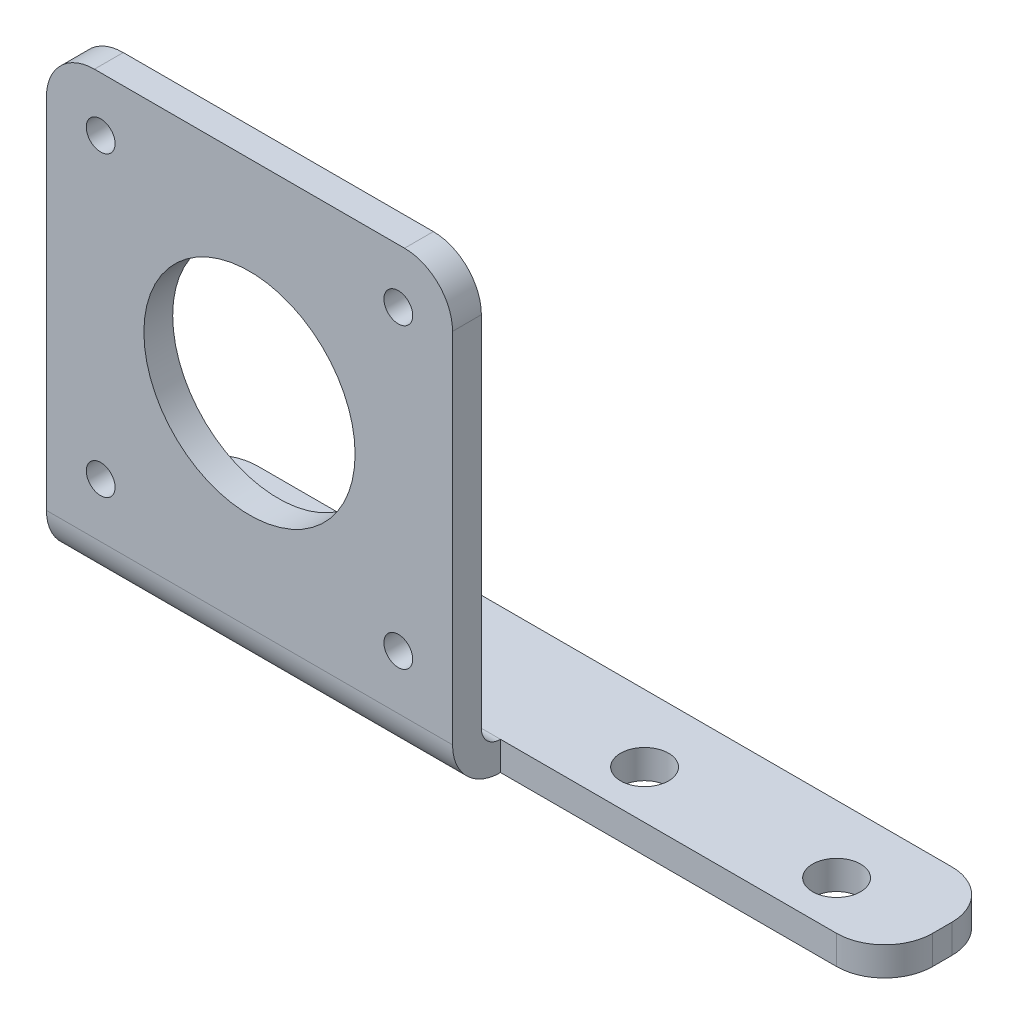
ISO-10303-21;
HEADER;
FILE_DESCRIPTION(('STEP AP214'),'2;1');
FILE_NAME('part.step','',(''),(''),'','','');
FILE_SCHEMA(('AUTOMOTIVE_DESIGN { 1 0 10303 214 1 1 1 1 }'));
ENDSEC;
DATA;
#1=APPLICATION_CONTEXT('core data for automotive mechanical design processes');
#2=APPLICATION_PROTOCOL_DEFINITION('international standard','automotive_design',2000,#1);
#3=PRODUCT_CONTEXT('',#1,'mechanical');
#4=PRODUCT('Part','Part','',(#3));
#5=PRODUCT_RELATED_PRODUCT_CATEGORY('part','',(#4));
#6=PRODUCT_DEFINITION_FORMATION('','',#4);
#7=PRODUCT_DEFINITION_CONTEXT('part definition',#1,'design');
#8=PRODUCT_DEFINITION('design','',#6,#7);
#9=PRODUCT_DEFINITION_SHAPE('','',#8);
#10=(LENGTH_UNIT() NAMED_UNIT(*) SI_UNIT(.MILLI.,.METRE.));
#11=(NAMED_UNIT(*) PLANE_ANGLE_UNIT() SI_UNIT($,.RADIAN.));
#12=(NAMED_UNIT(*) SI_UNIT($,.STERADIAN.) SOLID_ANGLE_UNIT());
#13=UNCERTAINTY_MEASURE_WITH_UNIT(LENGTH_MEASURE(1.E-05),#10,'distance_accuracy_value','');
#14=(GEOMETRIC_REPRESENTATION_CONTEXT(3) GLOBAL_UNCERTAINTY_ASSIGNED_CONTEXT((#13)) GLOBAL_UNIT_ASSIGNED_CONTEXT((#10,
#11,#12)) REPRESENTATION_CONTEXT('',''));
#15=CARTESIAN_POINT('',(0.,0.,0.));
#16=DIRECTION('',(0.,0.,1.));
#17=DIRECTION('',(1.,0.,0.));
#18=AXIS2_PLACEMENT_3D('',#15,#16,#17);
#19=CARTESIAN_POINT('',(60.,-23.15,0.));
#20=DIRECTION('',(0.,-1.,0.));
#21=DIRECTION('',(0.,0.,-1.));
#22=AXIS2_PLACEMENT_3D('',#19,#20,#21);
#23=PLANE('',#22);
#24=CARTESIAN_POINT('',(91.15,-23.15,-7.00000000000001));
#25=DIRECTION('',(0.,1.,0.));
#26=DIRECTION('',(0.,0.,1.));
#27=AXIS2_PLACEMENT_3D('',#24,#25,#26);
#28=CIRCLE('',#27,2.5);
#29=CARTESIAN_POINT('',(91.15,-23.15,-4.50000000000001));
#30=VERTEX_POINT('',#29);
#31=EDGE_CURVE('E216',#30,#30,#28,.F.);
#32=ORIENTED_EDGE('',*,*,#31,.T.);
#33=EDGE_LOOP('',(#32));
#34=FACE_BOUND('',#33,.T.);
#35=CARTESIAN_POINT('',(111.15,-23.15,-7.00000000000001));
#36=DIRECTION('',(0.,1.,0.));
#37=DIRECTION('',(0.,0.,1.));
#38=AXIS2_PLACEMENT_3D('',#35,#36,#37);
#39=CIRCLE('',#38,2.5);
#40=CARTESIAN_POINT('',(111.15,-23.15,-4.50000000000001));
#41=VERTEX_POINT('',#40);
#42=EDGE_CURVE('E213',#41,#41,#39,.F.);
#43=ORIENTED_EDGE('',*,*,#42,.T.);
#44=EDGE_LOOP('',(#43));
#45=FACE_BOUND('',#44,.T.);
#46=CARTESIAN_POINT('',(116.15,-23.15,-9.00000000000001));
#47=DIRECTION('',(0.,1.,0.));
#48=DIRECTION('',(0.,0.,1.));
#49=AXIS2_PLACEMENT_3D('',#46,#47,#48);
#50=CIRCLE('',#49,5.);
#51=CARTESIAN_POINT('',(116.15,-23.15,-14.));
#52=VERTEX_POINT('',#51);
#53=CARTESIAN_POINT('',(121.15,-23.15,-9.00000000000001));
#54=VERTEX_POINT('',#53);
#55=EDGE_CURVE('E220',#52,#54,#50,.F.);
#56=ORIENTED_EDGE('',*,*,#55,.F.);
#57=DIRECTION('',(1.,0.,0.));
#58=VECTOR('',#57,1.);
#59=CARTESIAN_POINT('',(121.15,-23.15,-14.));
#60=LINE('',#59,#58);
#61=CARTESIAN_POINT('',(43.85,-23.15,-14.));
#62=VERTEX_POINT('',#61);
#63=EDGE_CURVE('E119',#62,#52,#60,.T.);
#64=ORIENTED_EDGE('',*,*,#63,.F.);
#65=CARTESIAN_POINT('',(43.85,-23.15,-9.00000000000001));
#66=DIRECTION('',(0.,1.,0.));
#67=DIRECTION('',(0.,0.,1.));
#68=AXIS2_PLACEMENT_3D('',#65,#66,#67);
#69=CIRCLE('',#68,5.);
#70=CARTESIAN_POINT('',(38.85,-23.15,-9.00000000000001));
#71=VERTEX_POINT('',#70);
#72=EDGE_CURVE('E20',#71,#62,#69,.F.);
#73=ORIENTED_EDGE('',*,*,#72,.F.);
#74=DIRECTION('',(0.,0.,1.));
#75=VECTOR('',#74,1.);
#76=CARTESIAN_POINT('',(38.85,-23.15,-14.));
#77=LINE('',#76,#75);
#78=CARTESIAN_POINT('',(38.85,-23.15,-2.));
#79=VERTEX_POINT('',#78);
#80=EDGE_CURVE('E103',#79,#71,#77,.F.);
#81=ORIENTED_EDGE('',*,*,#80,.F.);
#82=DIRECTION('',(1.,0.,0.));
#83=VECTOR('',#82,1.);
#84=CARTESIAN_POINT('',(81.15,-23.15,-2.));
#85=LINE('',#84,#83);
#86=CARTESIAN_POINT('',(81.15,-23.15,-2.));
#87=VERTEX_POINT('',#86);
#88=EDGE_CURVE('E127',#79,#87,#85,.T.);
#89=ORIENTED_EDGE('',*,*,#88,.T.);
#90=DIRECTION('',(1.,0.,0.));
#91=VECTOR('',#90,1.);
#92=CARTESIAN_POINT('',(38.85,-23.15,-2.));
#93=LINE('',#92,#91);
#94=CARTESIAN_POINT('',(116.15,-23.15,-2.));
#95=VERTEX_POINT('',#94);
#96=EDGE_CURVE('E136',#95,#87,#93,.F.);
#97=ORIENTED_EDGE('',*,*,#96,.F.);
#98=CARTESIAN_POINT('',(116.15,-23.15,-7.));
#99=DIRECTION('',(0.,-1.,0.));
#100=DIRECTION('',(0.,0.,-1.));
#101=AXIS2_PLACEMENT_3D('',#98,#99,#100);
#102=CIRCLE('',#101,5.);
#103=CARTESIAN_POINT('',(121.15,-23.15,-7.00000000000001));
#104=VERTEX_POINT('',#103);
#105=EDGE_CURVE('E139',#104,#95,#102,.T.);
#106=ORIENTED_EDGE('',*,*,#105,.F.);
#107=DIRECTION('',(0.,0.,-1.));
#108=VECTOR('',#107,1.);
#109=CARTESIAN_POINT('',(121.15,-23.15,0.));
#110=LINE('',#109,#108);
#111=EDGE_CURVE('E137',#54,#104,#110,.F.);
#112=ORIENTED_EDGE('',*,*,#111,.F.);
#113=EDGE_LOOP('',(#56,#64,#73,#81,#89,#97,#106,#112));
#114=FACE_BOUND('',#113,.T.);
#115=ADVANCED_FACE('F17',(#34,#45,#114),#23,.F.);
#116=CARTESIAN_POINT('',(43.85,-26.15,-9.));
#117=DIRECTION('',(0.,1.,0.));
#118=DIRECTION('',(0.,0.,1.));
#119=AXIS2_PLACEMENT_3D('',#116,#117,#118);
#120=CYLINDRICAL_SURFACE('',#119,5.);
#121=ORIENTED_EDGE('',*,*,#72,.T.);
#122=DIRECTION('',(0.,1.,0.));
#123=VECTOR('',#122,1.);
#124=CARTESIAN_POINT('',(43.85,-26.15,-14.));
#125=LINE('',#124,#123);
#126=CARTESIAN_POINT('',(43.85,-26.15,-14.));
#127=VERTEX_POINT('',#126);
#128=EDGE_CURVE('E123',#127,#62,#125,.T.);
#129=ORIENTED_EDGE('',*,*,#128,.F.);
#130=CARTESIAN_POINT('',(43.85,-26.15,-9.));
#131=DIRECTION('',(0.,1.,0.));
#132=DIRECTION('',(0.,0.,1.));
#133=AXIS2_PLACEMENT_3D('',#130,#131,#132);
#134=CIRCLE('',#133,5.);
#135=CARTESIAN_POINT('',(38.85,-26.15,-9.));
#136=VERTEX_POINT('',#135);
#137=EDGE_CURVE('E126',#136,#127,#134,.F.);
#138=ORIENTED_EDGE('',*,*,#137,.F.);
#139=DIRECTION('',(0.,1.,0.));
#140=VECTOR('',#139,1.);
#141=CARTESIAN_POINT('',(38.85,-26.15,-9.));
#142=LINE('',#141,#140);
#143=EDGE_CURVE('E108',#71,#136,#142,.F.);
#144=ORIENTED_EDGE('',*,*,#143,.F.);
#145=EDGE_LOOP('',(#121,#129,#138,#144));
#146=FACE_BOUND('',#145,.T.);
#147=ADVANCED_FACE('F125',(#146),#120,.T.);
#148=CARTESIAN_POINT('',(121.15,-26.15,-14.));
#149=DIRECTION('',(0.,0.,-1.));
#150=DIRECTION('',(0.,1.,0.));
#151=AXIS2_PLACEMENT_3D('',#148,#149,#150);
#152=PLANE('',#151);
#153=ORIENTED_EDGE('',*,*,#63,.T.);
#154=DIRECTION('',(0.,1.,0.));
#155=VECTOR('',#154,1.);
#156=CARTESIAN_POINT('',(116.15,-26.15,-14.));
#157=LINE('',#156,#155);
#158=CARTESIAN_POINT('',(116.15,-26.15,-14.));
#159=VERTEX_POINT('',#158);
#160=EDGE_CURVE('E141',#159,#52,#157,.T.);
#161=ORIENTED_EDGE('',*,*,#160,.F.);
#162=DIRECTION('',(1.,0.,0.));
#163=VECTOR('',#162,1.);
#164=CARTESIAN_POINT('',(60.,-26.15,-14.));
#165=LINE('',#164,#163);
#166=EDGE_CURVE('E210',#127,#159,#165,.T.);
#167=ORIENTED_EDGE('',*,*,#166,.F.);
#168=ORIENTED_EDGE('',*,*,#128,.T.);
#169=EDGE_LOOP('',(#153,#161,#167,#168));
#170=FACE_BOUND('',#169,.T.);
#171=ADVANCED_FACE('F318',(#170),#152,.T.);
#172=CARTESIAN_POINT('',(116.15,-26.15,-9.));
#173=DIRECTION('',(0.,1.,0.));
#174=DIRECTION('',(0.,0.,1.));
#175=AXIS2_PLACEMENT_3D('',#172,#173,#174);
#176=CYLINDRICAL_SURFACE('',#175,5.);
#177=ORIENTED_EDGE('',*,*,#55,.T.);
#178=DIRECTION('',(0.,1.,0.));
#179=VECTOR('',#178,1.);
#180=CARTESIAN_POINT('',(121.15,-26.15,-9.));
#181=LINE('',#180,#179);
#182=CARTESIAN_POINT('',(121.15,-26.15,-9.));
#183=VERTEX_POINT('',#182);
#184=EDGE_CURVE('E140',#183,#54,#181,.T.);
#185=ORIENTED_EDGE('',*,*,#184,.F.);
#186=CARTESIAN_POINT('',(116.15,-26.15,-9.));
#187=DIRECTION('',(0.,1.,0.));
#188=DIRECTION('',(0.,0.,1.));
#189=AXIS2_PLACEMENT_3D('',#186,#187,#188);
#190=CIRCLE('',#189,5.);
#191=EDGE_CURVE('E208',#159,#183,#190,.F.);
#192=ORIENTED_EDGE('',*,*,#191,.F.);
#193=ORIENTED_EDGE('',*,*,#160,.T.);
#194=EDGE_LOOP('',(#177,#185,#192,#193));
#195=FACE_BOUND('',#194,.T.);
#196=ADVANCED_FACE('F316',(#195),#176,.T.);
#197=CARTESIAN_POINT('',(121.15,-26.15,0.));
#198=DIRECTION('',(1.,0.,0.));
#199=DIRECTION('',(0.,0.,-1.));
#200=AXIS2_PLACEMENT_3D('',#197,#198,#199);
#201=PLANE('',#200);
#202=ORIENTED_EDGE('',*,*,#111,.T.);
#203=DIRECTION('',(0.,-1.,0.));
#204=VECTOR('',#203,1.);
#205=CARTESIAN_POINT('',(121.15,-23.15,-7.00000000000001));
#206=LINE('',#205,#204);
#207=CARTESIAN_POINT('',(121.15,-26.15,-6.99999999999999));
#208=VERTEX_POINT('',#207);
#209=EDGE_CURVE('E219',#208,#104,#206,.F.);
#210=ORIENTED_EDGE('',*,*,#209,.F.);
#211=DIRECTION('',(0.,0.,-1.));
#212=VECTOR('',#211,1.);
#213=CARTESIAN_POINT('',(121.15,-26.15,0.));
#214=LINE('',#213,#212);
#215=EDGE_CURVE('E207',#183,#208,#214,.F.);
#216=ORIENTED_EDGE('',*,*,#215,.F.);
#217=ORIENTED_EDGE('',*,*,#184,.T.);
#218=EDGE_LOOP('',(#202,#210,#216,#217));
#219=FACE_BOUND('',#218,.T.);
#220=ADVANCED_FACE('F315',(#219),#201,.T.);
#221=CARTESIAN_POINT('',(116.15,-23.15,-7.));
#222=DIRECTION('',(0.,-1.,0.));
#223=DIRECTION('',(0.,0.,-1.));
#224=AXIS2_PLACEMENT_3D('',#221,#222,#223);
#225=CYLINDRICAL_SURFACE('',#224,5.);
#226=CARTESIAN_POINT('',(116.15,-26.15,-6.99999999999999));
#227=DIRECTION('',(0.,-1.,0.));
#228=DIRECTION('',(0.,0.,-1.));
#229=AXIS2_PLACEMENT_3D('',#226,#227,#228);
#230=CIRCLE('',#229,5.);
#231=CARTESIAN_POINT('',(116.15,-26.15,-1.99999999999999));
#232=VERTEX_POINT('',#231);
#233=EDGE_CURVE('E204',#208,#232,#230,.T.);
#234=ORIENTED_EDGE('',*,*,#233,.F.);
#235=ORIENTED_EDGE('',*,*,#209,.T.);
#236=ORIENTED_EDGE('',*,*,#105,.T.);
#237=DIRECTION('',(0.,-1.,0.));
#238=VECTOR('',#237,1.);
#239=CARTESIAN_POINT('',(116.15,-23.15,-2.));
#240=LINE('',#239,#238);
#241=EDGE_CURVE('E114',#232,#95,#240,.F.);
#242=ORIENTED_EDGE('',*,*,#241,.F.);
#243=EDGE_LOOP('',(#234,#235,#236,#242));
#244=FACE_BOUND('',#243,.T.);
#245=ADVANCED_FACE('F310',(#244),#225,.T.);
#246=CARTESIAN_POINT('',(91.15,-26.15,-7.));
#247=DIRECTION('',(0.,1.,0.));
#248=DIRECTION('',(0.,0.,1.));
#249=AXIS2_PLACEMENT_3D('',#246,#247,#248);
#250=CYLINDRICAL_SURFACE('',#249,2.5);
#251=CARTESIAN_POINT('',(91.15,-26.15,-7.));
#252=DIRECTION('',(0.,1.,0.));
#253=DIRECTION('',(0.,0.,1.));
#254=AXIS2_PLACEMENT_3D('',#251,#252,#253);
#255=CIRCLE('',#254,2.5);
#256=CARTESIAN_POINT('',(91.15,-26.15,-4.5));
#257=VERTEX_POINT('',#256);
#258=EDGE_CURVE('E201',#257,#257,#255,.T.);
#259=ORIENTED_EDGE('',*,*,#258,.F.);
#260=EDGE_LOOP('',(#259));
#261=FACE_BOUND('',#260,.T.);
#262=ORIENTED_EDGE('',*,*,#31,.F.);
#263=EDGE_LOOP('',(#262));
#264=FACE_BOUND('',#263,.T.);
#265=ADVANCED_FACE('F381',(#261,#264),#250,.F.);
#266=CARTESIAN_POINT('',(111.15,-26.15,-7.));
#267=DIRECTION('',(0.,1.,0.));
#268=DIRECTION('',(0.,0.,1.));
#269=AXIS2_PLACEMENT_3D('',#266,#267,#268);
#270=CYLINDRICAL_SURFACE('',#269,2.5);
#271=CARTESIAN_POINT('',(111.15,-26.15,-7.));
#272=DIRECTION('',(0.,1.,0.));
#273=DIRECTION('',(0.,0.,1.));
#274=AXIS2_PLACEMENT_3D('',#271,#272,#273);
#275=CIRCLE('',#274,2.5);
#276=CARTESIAN_POINT('',(111.15,-26.15,-4.5));
#277=VERTEX_POINT('',#276);
#278=EDGE_CURVE('E198',#277,#277,#275,.T.);
#279=ORIENTED_EDGE('',*,*,#278,.F.);
#280=EDGE_LOOP('',(#279));
#281=FACE_BOUND('',#280,.T.);
#282=ORIENTED_EDGE('',*,*,#42,.F.);
#283=EDGE_LOOP('',(#282));
#284=FACE_BOUND('',#283,.T.);
#285=ADVANCED_FACE('F378',(#281,#284),#270,.F.);
#286=CARTESIAN_POINT('',(38.85,-23.15,-2.));
#287=DIRECTION('',(0.,0.,1.));
#288=DIRECTION('',(0.,-1.,0.));
#289=AXIS2_PLACEMENT_3D('',#286,#287,#288);
#290=PLANE('',#289);
#291=DIRECTION('',(1.,0.,0.));
#292=VECTOR('',#291,1.);
#293=CARTESIAN_POINT('',(60.,-26.15,-2.));
#294=LINE('',#293,#292);
#295=CARTESIAN_POINT('',(81.15,-26.15,-2.));
#296=VERTEX_POINT('',#295);
#297=EDGE_CURVE('E129',#232,#296,#294,.F.);
#298=ORIENTED_EDGE('',*,*,#297,.F.);
#299=ORIENTED_EDGE('',*,*,#241,.T.);
#300=ORIENTED_EDGE('',*,*,#96,.T.);
#301=DIRECTION('',(0.,1.,0.));
#302=VECTOR('',#301,1.);
#303=CARTESIAN_POINT('',(81.15,-21.15,-2.));
#304=LINE('',#303,#302);
#305=EDGE_CURVE('E197',#87,#296,#304,.F.);
#306=ORIENTED_EDGE('',*,*,#305,.T.);
#307=EDGE_LOOP('',(#298,#299,#300,#306));
#308=FACE_BOUND('',#307,.T.);
#309=ADVANCED_FACE('F307',(#308),#290,.T.);
#310=CARTESIAN_POINT('',(81.15,-21.15,-2.));
#311=DIRECTION('',(1.,0.,0.));
#312=DIRECTION('',(0.,0.,-1.));
#313=AXIS2_PLACEMENT_3D('',#310,#311,#312);
#314=CYLINDRICAL_SURFACE('',#313,2.);
#315=CARTESIAN_POINT('',(81.15,-21.15,-2.));
#316=DIRECTION('',(1.,0.,0.));
#317=DIRECTION('',(0.,0.,-1.));
#318=AXIS2_PLACEMENT_3D('',#315,#316,#317);
#319=CIRCLE('',#318,2.);
#320=CARTESIAN_POINT('',(81.15,-21.15,0.));
#321=VERTEX_POINT('',#320);
#322=EDGE_CURVE('E194',#321,#87,#319,.T.);
#323=ORIENTED_EDGE('',*,*,#322,.T.);
#324=ORIENTED_EDGE('',*,*,#88,.F.);
#325=CARTESIAN_POINT('',(38.85,-21.15,-2.));
#326=DIRECTION('',(1.,0.,0.));
#327=DIRECTION('',(0.,0.,-1.));
#328=AXIS2_PLACEMENT_3D('',#325,#326,#327);
#329=CIRCLE('',#328,2.);
#330=CARTESIAN_POINT('',(38.85,-21.15,0.));
#331=VERTEX_POINT('',#330);
#332=EDGE_CURVE('E111',#331,#79,#329,.T.);
#333=ORIENTED_EDGE('',*,*,#332,.F.);
#334=DIRECTION('',(-1.,0.,0.));
#335=VECTOR('',#334,1.);
#336=CARTESIAN_POINT('',(60.,-21.15,0.));
#337=LINE('',#336,#335);
#338=EDGE_CURVE('E192',#321,#331,#337,.T.);
#339=ORIENTED_EDGE('',*,*,#338,.F.);
#340=EDGE_LOOP('',(#323,#324,#333,#339));
#341=FACE_BOUND('',#340,.T.);
#342=ADVANCED_FACE('F302',(#341),#314,.F.);
#343=CARTESIAN_POINT('',(60.,-26.15,0.));
#344=DIRECTION('',(0.,-1.,0.));
#345=DIRECTION('',(0.,0.,-1.));
#346=AXIS2_PLACEMENT_3D('',#343,#344,#345);
#347=PLANE('',#346);
#348=ORIENTED_EDGE('',*,*,#278,.T.);
#349=EDGE_LOOP('',(#348));
#350=FACE_BOUND('',#349,.T.);
#351=ORIENTED_EDGE('',*,*,#258,.T.);
#352=EDGE_LOOP('',(#351));
#353=FACE_BOUND('',#352,.T.);
#354=ORIENTED_EDGE('',*,*,#215,.T.);
#355=ORIENTED_EDGE('',*,*,#233,.T.);
#356=ORIENTED_EDGE('',*,*,#297,.T.);
#357=DIRECTION('',(1.,0.,0.));
#358=VECTOR('',#357,1.);
#359=CARTESIAN_POINT('',(81.15,-26.15,-2.));
#360=LINE('',#359,#358);
#361=CARTESIAN_POINT('',(38.85,-26.15,-1.99999999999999));
#362=VERTEX_POINT('',#361);
#363=EDGE_CURVE('E182',#362,#296,#360,.T.);
#364=ORIENTED_EDGE('',*,*,#363,.F.);
#365=DIRECTION('',(0.,0.,-1.));
#366=VECTOR('',#365,1.);
#367=CARTESIAN_POINT('',(38.85,-26.15,0.));
#368=LINE('',#367,#366);
#369=EDGE_CURVE('E212',#362,#136,#368,.T.);
#370=ORIENTED_EDGE('',*,*,#369,.T.);
#371=ORIENTED_EDGE('',*,*,#137,.T.);
#372=ORIENTED_EDGE('',*,*,#166,.T.);
#373=ORIENTED_EDGE('',*,*,#191,.T.);
#374=EDGE_LOOP('',(#354,#355,#356,#364,#370,#371,#372,#373));
#375=FACE_BOUND('',#374,.T.);
#376=ADVANCED_FACE('F311',(#350,#353,#375),#347,.T.);
#377=CARTESIAN_POINT('',(60.,0.,0.));
#378=DIRECTION('',(0.,0.,-1.));
#379=DIRECTION('',(-1.,0.,0.));
#380=AXIS2_PLACEMENT_3D('',#377,#378,#379);
#381=PLANE('',#380);
#382=CARTESIAN_POINT('',(44.5,-15.5,0.));
#383=DIRECTION('',(0.,0.,-1.));
#384=DIRECTION('',(-1.,0.,0.));
#385=AXIS2_PLACEMENT_3D('',#382,#383,#384);
#386=CIRCLE('',#385,1.5);
#387=CARTESIAN_POINT('',(43.,-15.5,0.));
#388=VERTEX_POINT('',#387);
#389=EDGE_CURVE('E163',#388,#388,#386,.F.);
#390=ORIENTED_EDGE('',*,*,#389,.T.);
#391=EDGE_LOOP('',(#390));
#392=FACE_BOUND('',#391,.T.);
#393=CARTESIAN_POINT('',(75.5,15.5,0.));
#394=DIRECTION('',(0.,0.,-1.));
#395=DIRECTION('',(-1.,0.,0.));
#396=AXIS2_PLACEMENT_3D('',#393,#394,#395);
#397=CIRCLE('',#396,1.5);
#398=CARTESIAN_POINT('',(74.,15.5,0.));
#399=VERTEX_POINT('',#398);
#400=EDGE_CURVE('E169',#399,#399,#397,.F.);
#401=ORIENTED_EDGE('',*,*,#400,.T.);
#402=EDGE_LOOP('',(#401));
#403=FACE_BOUND('',#402,.T.);
#404=CARTESIAN_POINT('',(60.,0.,0.));
#405=DIRECTION('',(0.,0.,-1.));
#406=DIRECTION('',(-1.,0.,0.));
#407=AXIS2_PLACEMENT_3D('',#404,#405,#406);
#408=CIRCLE('',#407,11.);
#409=CARTESIAN_POINT('',(49.,0.,0.));
#410=VERTEX_POINT('',#409);
#411=EDGE_CURVE('E175',#410,#410,#408,.F.);
#412=ORIENTED_EDGE('',*,*,#411,.T.);
#413=EDGE_LOOP('',(#412));
#414=FACE_BOUND('',#413,.T.);
#415=CARTESIAN_POINT('',(44.5,15.5,0.));
#416=DIRECTION('',(0.,0.,-1.));
#417=DIRECTION('',(-1.,0.,0.));
#418=AXIS2_PLACEMENT_3D('',#415,#416,#417);
#419=CIRCLE('',#418,1.5);
#420=CARTESIAN_POINT('',(43.,15.5,0.));
#421=VERTEX_POINT('',#420);
#422=EDGE_CURVE('E172',#421,#421,#419,.F.);
#423=ORIENTED_EDGE('',*,*,#422,.T.);
#424=EDGE_LOOP('',(#423));
#425=FACE_BOUND('',#424,.T.);
#426=CARTESIAN_POINT('',(75.5,-15.5,0.));
#427=DIRECTION('',(0.,0.,-1.));
#428=DIRECTION('',(-1.,0.,0.));
#429=AXIS2_PLACEMENT_3D('',#426,#427,#428);
#430=CIRCLE('',#429,1.5);
#431=CARTESIAN_POINT('',(74.,-15.5,0.));
#432=VERTEX_POINT('',#431);
#433=EDGE_CURVE('E166',#432,#432,#430,.F.);
#434=ORIENTED_EDGE('',*,*,#433,.T.);
#435=EDGE_LOOP('',(#434));
#436=FACE_BOUND('',#435,.T.);
#437=DIRECTION('',(0.,1.,0.));
#438=VECTOR('',#437,1.);
#439=CARTESIAN_POINT('',(38.85,21.15,0.));
#440=LINE('',#439,#438);
#441=CARTESIAN_POINT('',(38.85,16.15,0.));
#442=VERTEX_POINT('',#441);
#443=EDGE_CURVE('E178',#331,#442,#440,.T.);
#444=ORIENTED_EDGE('',*,*,#443,.T.);
#445=CARTESIAN_POINT('',(43.85,16.15,0.));
#446=DIRECTION('',(0.,0.,-1.));
#447=DIRECTION('',(-1.,0.,0.));
#448=AXIS2_PLACEMENT_3D('',#445,#446,#447);
#449=CIRCLE('',#448,5.);
#450=CARTESIAN_POINT('',(43.85,21.15,0.));
#451=VERTEX_POINT('',#450);
#452=EDGE_CURVE('E189',#451,#442,#449,.F.);
#453=ORIENTED_EDGE('',*,*,#452,.F.);
#454=DIRECTION('',(1.,0.,0.));
#455=VECTOR('',#454,1.);
#456=CARTESIAN_POINT('',(38.85,21.15,0.));
#457=LINE('',#456,#455);
#458=CARTESIAN_POINT('',(76.15,21.15,0.));
#459=VERTEX_POINT('',#458);
#460=EDGE_CURVE('E188',#451,#459,#457,.T.);
#461=ORIENTED_EDGE('',*,*,#460,.T.);
#462=CARTESIAN_POINT('',(76.15,16.15,0.));
#463=DIRECTION('',(0.,0.,-1.));
#464=DIRECTION('',(-1.,0.,0.));
#465=AXIS2_PLACEMENT_3D('',#462,#463,#464);
#466=CIRCLE('',#465,5.);
#467=CARTESIAN_POINT('',(81.15,16.15,0.));
#468=VERTEX_POINT('',#467);
#469=EDGE_CURVE('E185',#468,#459,#466,.F.);
#470=ORIENTED_EDGE('',*,*,#469,.F.);
#471=DIRECTION('',(0.,1.,0.));
#472=VECTOR('',#471,1.);
#473=CARTESIAN_POINT('',(81.15,21.15,0.));
#474=LINE('',#473,#472);
#475=EDGE_CURVE('E184',#468,#321,#474,.F.);
#476=ORIENTED_EDGE('',*,*,#475,.T.);
#477=ORIENTED_EDGE('',*,*,#338,.T.);
#478=EDGE_LOOP('',(#444,#453,#461,#470,#476,#477));
#479=FACE_BOUND('',#478,.T.);
#480=ADVANCED_FACE('F298',(#392,#403,#414,#425,#436,#479),#381,.T.);
#481=CARTESIAN_POINT('',(43.85,16.15,3.));
#482=DIRECTION('',(0.,0.,-1.));
#483=DIRECTION('',(-1.,0.,0.));
#484=AXIS2_PLACEMENT_3D('',#481,#482,#483);
#485=CYLINDRICAL_SURFACE('',#484,5.);
#486=ORIENTED_EDGE('',*,*,#452,.T.);
#487=DIRECTION('',(0.,0.,-1.));
#488=VECTOR('',#487,1.);
#489=CARTESIAN_POINT('',(38.85,16.15,3.));
#490=LINE('',#489,#488);
#491=CARTESIAN_POINT('',(38.85,16.15,3.));
#492=VERTEX_POINT('',#491);
#493=EDGE_CURVE('E181',#442,#492,#490,.F.);
#494=ORIENTED_EDGE('',*,*,#493,.T.);
#495=CARTESIAN_POINT('',(43.85,16.15,3.));
#496=DIRECTION('',(0.,0.,-1.));
#497=DIRECTION('',(-1.,0.,0.));
#498=AXIS2_PLACEMENT_3D('',#495,#496,#497);
#499=CIRCLE('',#498,5.);
#500=CARTESIAN_POINT('',(43.85,21.15,3.));
#501=VERTEX_POINT('',#500);
#502=EDGE_CURVE('E160',#492,#501,#499,.T.);
#503=ORIENTED_EDGE('',*,*,#502,.T.);
#504=DIRECTION('',(0.,0.,-1.));
#505=VECTOR('',#504,1.);
#506=CARTESIAN_POINT('',(43.85,21.15,3.));
#507=LINE('',#506,#505);
#508=EDGE_CURVE('E191',#501,#451,#507,.T.);
#509=ORIENTED_EDGE('',*,*,#508,.T.);
#510=EDGE_LOOP('',(#486,#494,#503,#509));
#511=FACE_BOUND('',#510,.T.);
#512=ADVANCED_FACE('F296',(#511),#485,.T.);
#513=CARTESIAN_POINT('',(38.85,21.15,3.));
#514=DIRECTION('',(0.,-1.,0.));
#515=DIRECTION('',(0.,0.,-1.));
#516=AXIS2_PLACEMENT_3D('',#513,#514,#515);
#517=PLANE('',#516);
#518=DIRECTION('',(0.,0.,-1.));
#519=VECTOR('',#518,1.);
#520=CARTESIAN_POINT('',(76.15,21.15,3.));
#521=LINE('',#520,#519);
#522=CARTESIAN_POINT('',(76.15,21.15,3.));
#523=VERTEX_POINT('',#522);
#524=EDGE_CURVE('E187',#459,#523,#521,.F.);
#525=ORIENTED_EDGE('',*,*,#524,.F.);
#526=ORIENTED_EDGE('',*,*,#460,.F.);
#527=ORIENTED_EDGE('',*,*,#508,.F.);
#528=DIRECTION('',(-1.,0.,0.));
#529=VECTOR('',#528,1.);
#530=CARTESIAN_POINT('',(60.,21.15,3.));
#531=LINE('',#530,#529);
#532=EDGE_CURVE('E159',#501,#523,#531,.F.);
#533=ORIENTED_EDGE('',*,*,#532,.T.);
#534=EDGE_LOOP('',(#525,#526,#527,#533));
#535=FACE_BOUND('',#534,.T.);
#536=ADVANCED_FACE('F294',(#535),#517,.F.);
#537=CARTESIAN_POINT('',(76.15,16.15,3.));
#538=DIRECTION('',(0.,0.,-1.));
#539=DIRECTION('',(-1.,0.,0.));
#540=AXIS2_PLACEMENT_3D('',#537,#538,#539);
#541=CYLINDRICAL_SURFACE('',#540,5.);
#542=ORIENTED_EDGE('',*,*,#469,.T.);
#543=ORIENTED_EDGE('',*,*,#524,.T.);
#544=CARTESIAN_POINT('',(76.15,16.15,3.));
#545=DIRECTION('',(0.,0.,-1.));
#546=DIRECTION('',(-1.,0.,0.));
#547=AXIS2_PLACEMENT_3D('',#544,#545,#546);
#548=CIRCLE('',#547,5.);
#549=CARTESIAN_POINT('',(81.15,16.15,3.));
#550=VERTEX_POINT('',#549);
#551=EDGE_CURVE('E155',#523,#550,#548,.T.);
#552=ORIENTED_EDGE('',*,*,#551,.T.);
#553=DIRECTION('',(0.,0.,1.));
#554=VECTOR('',#553,1.);
#555=CARTESIAN_POINT('',(81.15,16.15,3.));
#556=LINE('',#555,#554);
#557=EDGE_CURVE('E236',#550,#468,#556,.F.);
#558=ORIENTED_EDGE('',*,*,#557,.T.);
#559=EDGE_LOOP('',(#542,#543,#552,#558));
#560=FACE_BOUND('',#559,.T.);
#561=ADVANCED_FACE('F291',(#560),#541,.T.);
#562=CARTESIAN_POINT('',(81.15,21.15,3.));
#563=DIRECTION('',(-1.,0.,0.));
#564=DIRECTION('',(0.,0.,1.));
#565=AXIS2_PLACEMENT_3D('',#562,#563,#564);
#566=PLANE('',#565);
#567=DIRECTION('',(0.,1.,0.));
#568=VECTOR('',#567,1.);
#569=CARTESIAN_POINT('',(81.15,0.,3.));
#570=LINE('',#569,#568);
#571=CARTESIAN_POINT('',(81.15,-21.15,3.));
#572=VERTEX_POINT('',#571);
#573=EDGE_CURVE('E158',#550,#572,#570,.F.);
#574=ORIENTED_EDGE('',*,*,#573,.T.);
#575=CARTESIAN_POINT('',(81.15,-21.15,-2.));
#576=DIRECTION('',(1.,0.,0.));
#577=DIRECTION('',(0.,0.,-1.));
#578=AXIS2_PLACEMENT_3D('',#575,#576,#577);
#579=CIRCLE('',#578,5.);
#580=EDGE_CURVE('E179',#296,#572,#579,.F.);
#581=ORIENTED_EDGE('',*,*,#580,.F.);
#582=ORIENTED_EDGE('',*,*,#305,.F.);
#583=ORIENTED_EDGE('',*,*,#322,.F.);
#584=ORIENTED_EDGE('',*,*,#475,.F.);
#585=ORIENTED_EDGE('',*,*,#557,.F.);
#586=EDGE_LOOP('',(#574,#581,#582,#583,#584,#585));
#587=FACE_BOUND('',#586,.T.);
#588=ADVANCED_FACE('F279',(#587),#566,.F.);
#589=CARTESIAN_POINT('',(81.15,-21.15,-2.));
#590=DIRECTION('',(1.,0.,0.));
#591=DIRECTION('',(0.,0.,-1.));
#592=AXIS2_PLACEMENT_3D('',#589,#590,#591);
#593=CYLINDRICAL_SURFACE('',#592,5.);
#594=ORIENTED_EDGE('',*,*,#363,.T.);
#595=ORIENTED_EDGE('',*,*,#580,.T.);
#596=DIRECTION('',(-1.,0.,0.));
#597=VECTOR('',#596,1.);
#598=CARTESIAN_POINT('',(60.,-21.15,3.));
#599=LINE('',#598,#597);
#600=CARTESIAN_POINT('',(38.85,-21.15,3.));
#601=VERTEX_POINT('',#600);
#602=EDGE_CURVE('E255',#572,#601,#599,.T.);
#603=ORIENTED_EDGE('',*,*,#602,.T.);
#604=CARTESIAN_POINT('',(38.85,-21.15,-2.));
#605=DIRECTION('',(1.,0.,0.));
#606=DIRECTION('',(0.,0.,-1.));
#607=AXIS2_PLACEMENT_3D('',#604,#605,#606);
#608=CIRCLE('',#607,5.);
#609=EDGE_CURVE('E35',#601,#362,#608,.T.);
#610=ORIENTED_EDGE('',*,*,#609,.T.);
#611=EDGE_LOOP('',(#594,#595,#603,#610));
#612=FACE_BOUND('',#611,.T.);
#613=ADVANCED_FACE('F274',(#612),#593,.T.);
#614=CARTESIAN_POINT('',(38.85,21.15,3.));
#615=DIRECTION('',(1.,0.,0.));
#616=DIRECTION('',(0.,0.,-1.));
#617=AXIS2_PLACEMENT_3D('',#614,#615,#616);
#618=PLANE('',#617);
#619=ORIENTED_EDGE('',*,*,#443,.F.);
#620=ORIENTED_EDGE('',*,*,#332,.T.);
#621=ORIENTED_EDGE('',*,*,#80,.T.);
#622=ORIENTED_EDGE('',*,*,#143,.T.);
#623=ORIENTED_EDGE('',*,*,#369,.F.);
#624=ORIENTED_EDGE('',*,*,#609,.F.);
#625=DIRECTION('',(0.,1.,0.));
#626=VECTOR('',#625,1.);
#627=CARTESIAN_POINT('',(38.85,0.,3.));
#628=LINE('',#627,#626);
#629=EDGE_CURVE('E154',#601,#492,#628,.T.);
#630=ORIENTED_EDGE('',*,*,#629,.T.);
#631=ORIENTED_EDGE('',*,*,#493,.F.);
#632=EDGE_LOOP('',(#619,#620,#621,#622,#623,#624,#630,#631));
#633=FACE_BOUND('',#632,.T.);
#634=ADVANCED_FACE('F106',(#633),#618,.F.);
#635=CARTESIAN_POINT('',(60.,0.,3.));
#636=DIRECTION('',(0.,0.,-1.));
#637=DIRECTION('',(-1.,0.,0.));
#638=AXIS2_PLACEMENT_3D('',#635,#636,#637);
#639=CYLINDRICAL_SURFACE('',#638,11.);
#640=CARTESIAN_POINT('',(60.,0.,3.));
#641=DIRECTION('',(0.,0.,-1.));
#642=DIRECTION('',(-1.,0.,0.));
#643=AXIS2_PLACEMENT_3D('',#640,#641,#642);
#644=CIRCLE('',#643,11.);
#645=CARTESIAN_POINT('',(49.,0.,3.));
#646=VERTEX_POINT('',#645);
#647=EDGE_CURVE('E151',#646,#646,#644,.F.);
#648=ORIENTED_EDGE('',*,*,#647,.T.);
#649=EDGE_LOOP('',(#648));
#650=FACE_BOUND('',#649,.T.);
#651=ORIENTED_EDGE('',*,*,#411,.F.);
#652=EDGE_LOOP('',(#651));
#653=FACE_BOUND('',#652,.T.);
#654=ADVANCED_FACE('F351',(#650,#653),#639,.F.);
#655=CARTESIAN_POINT('',(44.5,15.5,3.));
#656=DIRECTION('',(0.,0.,-1.));
#657=DIRECTION('',(-1.,0.,0.));
#658=AXIS2_PLACEMENT_3D('',#655,#656,#657);
#659=CYLINDRICAL_SURFACE('',#658,1.5);
#660=CARTESIAN_POINT('',(44.5,15.5,3.));
#661=DIRECTION('',(0.,0.,-1.));
#662=DIRECTION('',(-1.,0.,0.));
#663=AXIS2_PLACEMENT_3D('',#660,#661,#662);
#664=CIRCLE('',#663,1.5);
#665=CARTESIAN_POINT('',(43.,15.5,3.));
#666=VERTEX_POINT('',#665);
#667=EDGE_CURVE('E148',#666,#666,#664,.F.);
#668=ORIENTED_EDGE('',*,*,#667,.T.);
#669=EDGE_LOOP('',(#668));
#670=FACE_BOUND('',#669,.T.);
#671=ORIENTED_EDGE('',*,*,#422,.F.);
#672=EDGE_LOOP('',(#671));
#673=FACE_BOUND('',#672,.T.);
#674=ADVANCED_FACE('F347',(#670,#673),#659,.F.);
#675=CARTESIAN_POINT('',(75.5,15.5,3.));
#676=DIRECTION('',(0.,0.,-1.));
#677=DIRECTION('',(-1.,0.,0.));
#678=AXIS2_PLACEMENT_3D('',#675,#676,#677);
#679=CYLINDRICAL_SURFACE('',#678,1.5);
#680=CARTESIAN_POINT('',(75.5,15.5,3.));
#681=DIRECTION('',(0.,0.,-1.));
#682=DIRECTION('',(-1.,0.,0.));
#683=AXIS2_PLACEMENT_3D('',#680,#681,#682);
#684=CIRCLE('',#683,1.5);
#685=CARTESIAN_POINT('',(74.,15.5,3.));
#686=VERTEX_POINT('',#685);
#687=EDGE_CURVE('E145',#686,#686,#684,.F.);
#688=ORIENTED_EDGE('',*,*,#687,.T.);
#689=EDGE_LOOP('',(#688));
#690=FACE_BOUND('',#689,.T.);
#691=ORIENTED_EDGE('',*,*,#400,.F.);
#692=EDGE_LOOP('',(#691));
#693=FACE_BOUND('',#692,.T.);
#694=ADVANCED_FACE('F343',(#690,#693),#679,.F.);
#695=CARTESIAN_POINT('',(75.5,-15.5,3.));
#696=DIRECTION('',(0.,0.,-1.));
#697=DIRECTION('',(-1.,0.,0.));
#698=AXIS2_PLACEMENT_3D('',#695,#696,#697);
#699=CYLINDRICAL_SURFACE('',#698,1.5);
#700=CARTESIAN_POINT('',(75.5,-15.5,3.));
#701=DIRECTION('',(0.,0.,-1.));
#702=DIRECTION('',(-1.,0.,0.));
#703=AXIS2_PLACEMENT_3D('',#700,#701,#702);
#704=CIRCLE('',#703,1.5);
#705=CARTESIAN_POINT('',(74.,-15.5,3.));
#706=VERTEX_POINT('',#705);
#707=EDGE_CURVE('E26',#706,#706,#704,.F.);
#708=ORIENTED_EDGE('',*,*,#707,.T.);
#709=EDGE_LOOP('',(#708));
#710=FACE_BOUND('',#709,.T.);
#711=ORIENTED_EDGE('',*,*,#433,.F.);
#712=EDGE_LOOP('',(#711));
#713=FACE_BOUND('',#712,.T.);
#714=ADVANCED_FACE('F335',(#710,#713),#699,.F.);
#715=CARTESIAN_POINT('',(44.5,-15.5,3.));
#716=DIRECTION('',(0.,0.,-1.));
#717=DIRECTION('',(-1.,0.,0.));
#718=AXIS2_PLACEMENT_3D('',#715,#716,#717);
#719=CYLINDRICAL_SURFACE('',#718,1.5);
#720=CARTESIAN_POINT('',(44.5,-15.5,3.));
#721=DIRECTION('',(0.,0.,-1.));
#722=DIRECTION('',(-1.,0.,0.));
#723=AXIS2_PLACEMENT_3D('',#720,#721,#722);
#724=CIRCLE('',#723,1.5);
#725=CARTESIAN_POINT('',(43.,-15.5,3.));
#726=VERTEX_POINT('',#725);
#727=EDGE_CURVE('E11',#726,#726,#724,.F.);
#728=ORIENTED_EDGE('',*,*,#727,.T.);
#729=EDGE_LOOP('',(#728));
#730=FACE_BOUND('',#729,.T.);
#731=ORIENTED_EDGE('',*,*,#389,.F.);
#732=EDGE_LOOP('',(#731));
#733=FACE_BOUND('',#732,.T.);
#734=ADVANCED_FACE('F329',(#730,#733),#719,.F.);
#735=CARTESIAN_POINT('',(60.,0.,3.));
#736=DIRECTION('',(0.,0.,-1.));
#737=DIRECTION('',(-1.,0.,0.));
#738=AXIS2_PLACEMENT_3D('',#735,#736,#737);
#739=PLANE('',#738);
#740=ORIENTED_EDGE('',*,*,#727,.F.);
#741=EDGE_LOOP('',(#740));
#742=FACE_BOUND('',#741,.T.);
#743=ORIENTED_EDGE('',*,*,#707,.F.);
#744=EDGE_LOOP('',(#743));
#745=FACE_BOUND('',#744,.T.);
#746=ORIENTED_EDGE('',*,*,#687,.F.);
#747=EDGE_LOOP('',(#746));
#748=FACE_BOUND('',#747,.T.);
#749=ORIENTED_EDGE('',*,*,#667,.F.);
#750=EDGE_LOOP('',(#749));
#751=FACE_BOUND('',#750,.T.);
#752=ORIENTED_EDGE('',*,*,#647,.F.);
#753=EDGE_LOOP('',(#752));
#754=FACE_BOUND('',#753,.T.);
#755=ORIENTED_EDGE('',*,*,#602,.F.);
#756=ORIENTED_EDGE('',*,*,#573,.F.);
#757=ORIENTED_EDGE('',*,*,#551,.F.);
#758=ORIENTED_EDGE('',*,*,#532,.F.);
#759=ORIENTED_EDGE('',*,*,#502,.F.);
#760=ORIENTED_EDGE('',*,*,#629,.F.);
#761=EDGE_LOOP('',(#755,#756,#757,#758,#759,#760));
#762=FACE_BOUND('',#761,.T.);
#763=ADVANCED_FACE('F270',(#742,#745,#748,#751,#754,#762),#739,.F.);
#764=CLOSED_SHELL('',(#115,#147,#171,#196,#220,#245,#265,#285,#309,#342,#376,#480,#512,#536,
#561,#588,#613,#634,#654,#674,#694,#714,#734,#763));
#765=MANIFOLD_SOLID_BREP('B1',#764);
#766=ADVANCED_BREP_SHAPE_REPRESENTATION('',(#18,#765),#14);
#767=SHAPE_DEFINITION_REPRESENTATION(#9,#766);
ENDSEC;
END-ISO-10303-21;
